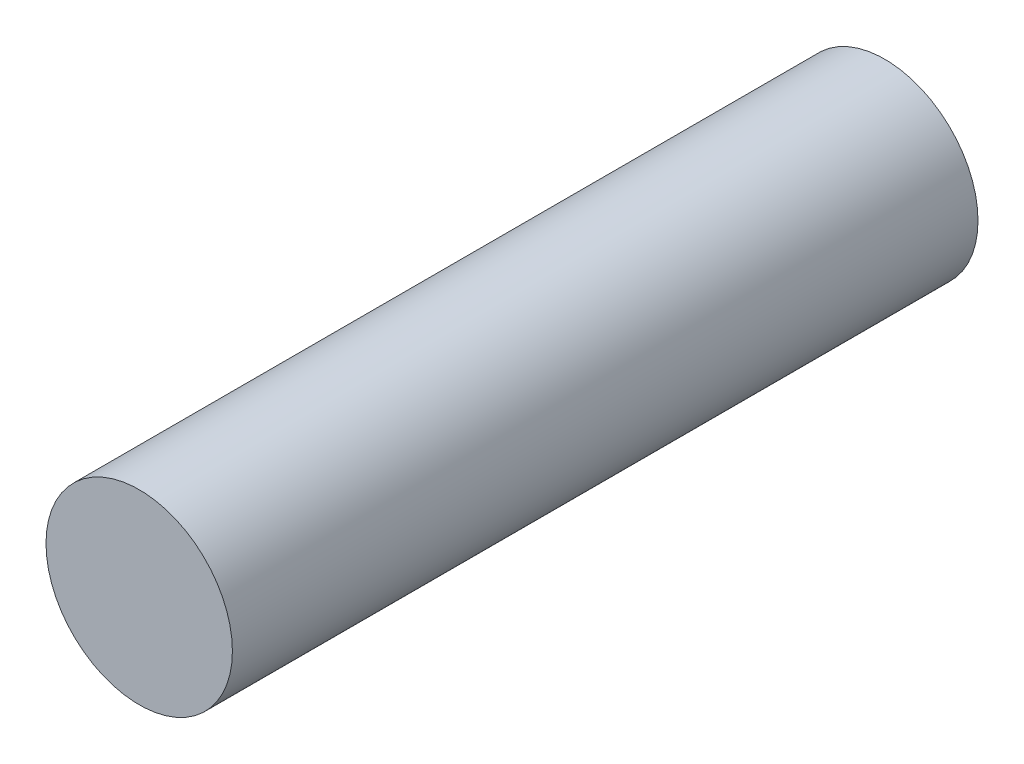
from build123d import *

# Parameters (mm, degrees)
ESQUISSE1_R          = 1.25
BASE_EXTRUSION_DEPTH = 10


with BuildPart() as part:
    # Esquisse1 → Base-Extrusion (new body)
    with BuildSketch(Plane.XY):
        Circle(ESQUISSE1_R)
    extrude(amount=BASE_EXTRUSION_DEPTH)


solid = part.part
